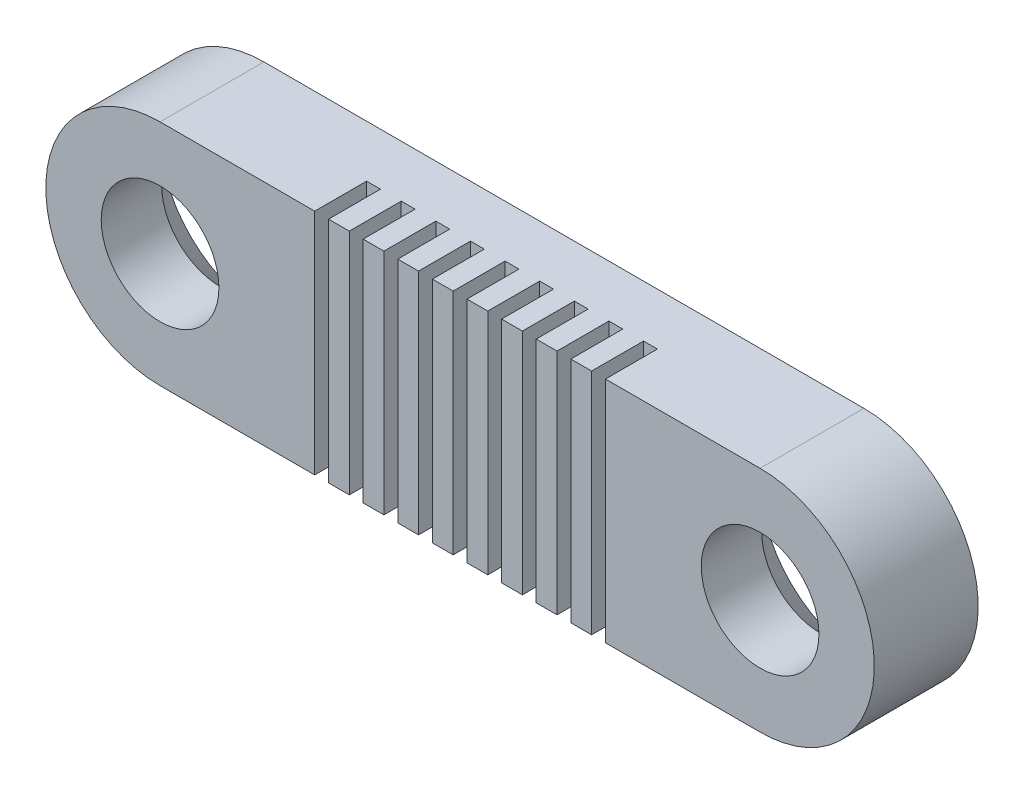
ISO-10303-21;
HEADER;
FILE_DESCRIPTION(('STEP AP214'),'2;1');
FILE_NAME('part.step','',(''),(''),'','','');
FILE_SCHEMA(('AUTOMOTIVE_DESIGN { 1 0 10303 214 1 1 1 1 }'));
ENDSEC;
DATA;
#1=APPLICATION_CONTEXT('core data for automotive mechanical design processes');
#2=APPLICATION_PROTOCOL_DEFINITION('international standard','automotive_design',2000,#1);
#3=PRODUCT_CONTEXT('',#1,'mechanical');
#4=PRODUCT('Part','Part','',(#3));
#5=PRODUCT_RELATED_PRODUCT_CATEGORY('part','',(#4));
#6=PRODUCT_DEFINITION_FORMATION('','',#4);
#7=PRODUCT_DEFINITION_CONTEXT('part definition',#1,'design');
#8=PRODUCT_DEFINITION('design','',#6,#7);
#9=PRODUCT_DEFINITION_SHAPE('','',#8);
#10=(LENGTH_UNIT() NAMED_UNIT(*) SI_UNIT(.MILLI.,.METRE.));
#11=(NAMED_UNIT(*) PLANE_ANGLE_UNIT() SI_UNIT($,.RADIAN.));
#12=(NAMED_UNIT(*) SI_UNIT($,.STERADIAN.) SOLID_ANGLE_UNIT());
#13=UNCERTAINTY_MEASURE_WITH_UNIT(LENGTH_MEASURE(1.E-05),#10,'distance_accuracy_value','');
#14=(GEOMETRIC_REPRESENTATION_CONTEXT(3) GLOBAL_UNCERTAINTY_ASSIGNED_CONTEXT((#13)) GLOBAL_UNIT_ASSIGNED_CONTEXT((#10,
#11,#12)) REPRESENTATION_CONTEXT('',''));
#15=CARTESIAN_POINT('',(0.,0.,0.));
#16=DIRECTION('',(0.,0.,1.));
#17=DIRECTION('',(1.,0.,0.));
#18=AXIS2_PLACEMENT_3D('',#15,#16,#17);
#19=CARTESIAN_POINT('',(17.3330952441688,-3.3,3.));
#20=DIRECTION('',(0.,0.,1.));
#21=DIRECTION('',(1.,0.,0.));
#22=AXIS2_PLACEMENT_3D('',#19,#20,#21);
#23=PLANE('',#22);
#24=DIRECTION('',(1.,0.,0.));
#25=VECTOR('',#24,1.);
#26=CARTESIAN_POINT('',(0.,-6.6,3.));
#27=LINE('',#26,#25);
#28=CARTESIAN_POINT('',(5.8665476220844,-6.6,3.));
#29=VERTEX_POINT('',#28);
#30=CARTESIAN_POINT('',(6.46654762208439,-6.6,3.));
#31=VERTEX_POINT('',#30);
#32=EDGE_CURVE('E347',#29,#31,#27,.T.);
#33=ORIENTED_EDGE('',*,*,#32,.T.);
#34=DIRECTION('',(0.,-1.,0.));
#35=VECTOR('',#34,1.);
#36=CARTESIAN_POINT('',(6.46654762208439,10.,3.));
#37=LINE('',#36,#35);
#38=CARTESIAN_POINT('',(6.46654762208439,0.,3.));
#39=VERTEX_POINT('',#38);
#40=EDGE_CURVE('E426',#39,#31,#37,.T.);
#41=ORIENTED_EDGE('',*,*,#40,.F.);
#42=DIRECTION('',(-1.,0.,0.));
#43=VECTOR('',#42,1.);
#44=CARTESIAN_POINT('',(17.3330952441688,0.,3.));
#45=LINE('',#44,#43);
#46=CARTESIAN_POINT('',(5.8665476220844,0.,3.));
#47=VERTEX_POINT('',#46);
#48=EDGE_CURVE('E590',#39,#47,#45,.T.);
#49=ORIENTED_EDGE('',*,*,#48,.T.);
#50=DIRECTION('',(0.,-1.,0.));
#51=VECTOR('',#50,1.);
#52=CARTESIAN_POINT('',(5.8665476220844,10.,3.));
#53=LINE('',#52,#51);
#54=EDGE_CURVE('E634',#47,#29,#53,.T.);
#55=ORIENTED_EDGE('',*,*,#54,.T.);
#56=EDGE_LOOP('',(#33,#41,#49,#55));
#57=FACE_BOUND('',#56,.T.);
#58=ADVANCED_FACE('F44',(#57),#23,.T.);
#59=CARTESIAN_POINT('',(7.46654762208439,0.,3.));
#60=VERTEX_POINT('',#59);
#61=CARTESIAN_POINT('',(6.8665476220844,0.,3.));
#62=VERTEX_POINT('',#61);
#63=EDGE_CURVE('E585',#60,#62,#45,.T.);
#64=ORIENTED_EDGE('',*,*,#63,.T.);
#65=DIRECTION('',(0.,-1.,0.));
#66=VECTOR('',#65,1.);
#67=CARTESIAN_POINT('',(6.8665476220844,10.,3.));
#68=LINE('',#67,#66);
#69=CARTESIAN_POINT('',(6.8665476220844,-6.6,3.));
#70=VERTEX_POINT('',#69);
#71=EDGE_CURVE('E608',#62,#70,#68,.T.);
#72=ORIENTED_EDGE('',*,*,#71,.T.);
#73=CARTESIAN_POINT('',(7.46654762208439,-6.6,3.));
#74=VERTEX_POINT('',#73);
#75=EDGE_CURVE('E362',#70,#74,#27,.T.);
#76=ORIENTED_EDGE('',*,*,#75,.T.);
#77=DIRECTION('',(0.,-1.,0.));
#78=VECTOR('',#77,1.);
#79=CARTESIAN_POINT('',(7.46654762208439,10.,3.));
#80=LINE('',#79,#78);
#81=EDGE_CURVE('E445',#60,#74,#80,.T.);
#82=ORIENTED_EDGE('',*,*,#81,.F.);
#83=EDGE_LOOP('',(#64,#72,#76,#82));
#84=FACE_BOUND('',#83,.T.);
#85=ADVANCED_FACE('F865',(#84),#23,.T.);
#86=CARTESIAN_POINT('',(4.8665476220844,-6.6,3.));
#87=VERTEX_POINT('',#86);
#88=CARTESIAN_POINT('',(5.46654762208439,-6.6,3.));
#89=VERTEX_POINT('',#88);
#90=EDGE_CURVE('E337',#87,#89,#27,.T.);
#91=ORIENTED_EDGE('',*,*,#90,.T.);
#92=DIRECTION('',(0.,-1.,0.));
#93=VECTOR('',#92,1.);
#94=CARTESIAN_POINT('',(5.46654762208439,10.,3.));
#95=LINE('',#94,#93);
#96=CARTESIAN_POINT('',(5.46654762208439,0.,3.));
#97=VERTEX_POINT('',#96);
#98=EDGE_CURVE('E631',#97,#89,#95,.T.);
#99=ORIENTED_EDGE('',*,*,#98,.F.);
#100=CARTESIAN_POINT('',(4.8665476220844,0.,3.));
#101=VERTEX_POINT('',#100);
#102=EDGE_CURVE('E593',#97,#101,#45,.T.);
#103=ORIENTED_EDGE('',*,*,#102,.T.);
#104=DIRECTION('',(0.,-1.,0.));
#105=VECTOR('',#104,1.);
#106=CARTESIAN_POINT('',(4.8665476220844,10.,3.));
#107=LINE('',#106,#105);
#108=EDGE_CURVE('E316',#101,#87,#107,.T.);
#109=ORIENTED_EDGE('',*,*,#108,.T.);
#110=EDGE_LOOP('',(#91,#99,#103,#109));
#111=FACE_BOUND('',#110,.T.);
#112=ADVANCED_FACE('F897',(#111),#23,.T.);
#113=CARTESIAN_POINT('',(0.,-3.3,3.));
#114=DIRECTION('',(0.,0.,1.));
#115=DIRECTION('',(1.,0.,0.));
#116=AXIS2_PLACEMENT_3D('',#113,#114,#115);
#117=CIRCLE('',#116,1.69999999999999);
#118=CARTESIAN_POINT('',(1.69999999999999,-3.3,3.));
#119=VERTEX_POINT('',#118);
#120=EDGE_CURVE('E554',#119,#119,#117,.T.);
#121=ORIENTED_EDGE('',*,*,#120,.F.);
#122=EDGE_LOOP('',(#121));
#123=FACE_BOUND('',#122,.T.);
#124=CARTESIAN_POINT('',(0.,-6.6,3.));
#125=VERTEX_POINT('',#124);
#126=CARTESIAN_POINT('',(4.46654762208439,-6.6,3.));
#127=VERTEX_POINT('',#126);
#128=EDGE_CURVE('E323',#125,#127,#27,.T.);
#129=ORIENTED_EDGE('',*,*,#128,.T.);
#130=DIRECTION('',(0.,-1.,0.));
#131=VECTOR('',#130,1.);
#132=CARTESIAN_POINT('',(4.46654762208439,10.,3.));
#133=LINE('',#132,#131);
#134=CARTESIAN_POINT('',(4.46654762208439,0.,3.));
#135=VERTEX_POINT('',#134);
#136=EDGE_CURVE('E303',#135,#127,#133,.T.);
#137=ORIENTED_EDGE('',*,*,#136,.F.);
#138=CARTESIAN_POINT('',(0.,0.,3.));
#139=VERTEX_POINT('',#138);
#140=EDGE_CURVE('E567',#135,#139,#45,.T.);
#141=ORIENTED_EDGE('',*,*,#140,.T.);
#142=CARTESIAN_POINT('',(0.,-3.3,3.));
#143=DIRECTION('',(0.,0.,1.));
#144=DIRECTION('',(1.,0.,0.));
#145=AXIS2_PLACEMENT_3D('',#142,#143,#144);
#146=CIRCLE('',#145,3.3);
#147=EDGE_CURVE('E333',#139,#125,#146,.T.);
#148=ORIENTED_EDGE('',*,*,#147,.T.);
#149=EDGE_LOOP('',(#129,#137,#141,#148));
#150=FACE_BOUND('',#149,.T.);
#151=ADVANCED_FACE('F331',(#123,#150),#23,.T.);
#152=CARTESIAN_POINT('',(8.46654762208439,0.,3.));
#153=VERTEX_POINT('',#152);
#154=CARTESIAN_POINT('',(7.8665476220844,0.,3.));
#155=VERTEX_POINT('',#154);
#156=EDGE_CURVE('E573',#153,#155,#45,.T.);
#157=ORIENTED_EDGE('',*,*,#156,.T.);
#158=DIRECTION('',(0.,-1.,0.));
#159=VECTOR('',#158,1.);
#160=CARTESIAN_POINT('',(7.8665476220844,10.,3.));
#161=LINE('',#160,#159);
#162=CARTESIAN_POINT('',(7.8665476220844,-6.6,3.));
#163=VERTEX_POINT('',#162);
#164=EDGE_CURVE('E441',#155,#163,#161,.T.);
#165=ORIENTED_EDGE('',*,*,#164,.T.);
#166=CARTESIAN_POINT('',(8.46654762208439,-6.6,3.));
#167=VERTEX_POINT('',#166);
#168=EDGE_CURVE('E354',#163,#167,#27,.T.);
#169=ORIENTED_EDGE('',*,*,#168,.T.);
#170=DIRECTION('',(0.,-1.,0.));
#171=VECTOR('',#170,1.);
#172=CARTESIAN_POINT('',(8.46654762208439,10.,3.));
#173=LINE('',#172,#171);
#174=EDGE_CURVE('E541',#153,#167,#173,.T.);
#175=ORIENTED_EDGE('',*,*,#174,.F.);
#176=EDGE_LOOP('',(#157,#165,#169,#175));
#177=FACE_BOUND('',#176,.T.);
#178=ADVANCED_FACE('F849',(#177),#23,.T.);
#179=CARTESIAN_POINT('',(11.8665476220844,-6.6,3.));
#180=VERTEX_POINT('',#179);
#181=CARTESIAN_POINT('',(12.4665476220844,-6.6,3.));
#182=VERTEX_POINT('',#181);
#183=EDGE_CURVE('E351',#180,#182,#27,.T.);
#184=ORIENTED_EDGE('',*,*,#183,.T.);
#185=DIRECTION('',(0.,-1.,0.));
#186=VECTOR('',#185,1.);
#187=CARTESIAN_POINT('',(12.4665476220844,10.,3.));
#188=LINE('',#187,#186);
#189=CARTESIAN_POINT('',(12.4665476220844,0.,3.));
#190=VERTEX_POINT('',#189);
#191=EDGE_CURVE('E383',#190,#182,#188,.T.);
#192=ORIENTED_EDGE('',*,*,#191,.F.);
#193=CARTESIAN_POINT('',(11.8665476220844,0.,3.));
#194=VERTEX_POINT('',#193);
#195=EDGE_CURVE('E572',#190,#194,#45,.T.);
#196=ORIENTED_EDGE('',*,*,#195,.T.);
#197=DIRECTION('',(0.,-1.,0.));
#198=VECTOR('',#197,1.);
#199=CARTESIAN_POINT('',(11.8665476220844,10.,3.));
#200=LINE('',#199,#198);
#201=EDGE_CURVE('E385',#194,#180,#200,.T.);
#202=ORIENTED_EDGE('',*,*,#201,.T.);
#203=EDGE_LOOP('',(#184,#192,#196,#202));
#204=FACE_BOUND('',#203,.T.);
#205=ADVANCED_FACE('F381',(#204),#23,.T.);
#206=CARTESIAN_POINT('',(17.3330952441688,-3.3,3.));
#207=DIRECTION('',(0.,0.,1.));
#208=DIRECTION('',(1.,0.,0.));
#209=AXIS2_PLACEMENT_3D('',#206,#207,#208);
#210=CIRCLE('',#209,1.69999999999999);
#211=CARTESIAN_POINT('',(19.0330952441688,-3.3,3.));
#212=VERTEX_POINT('',#211);
#213=EDGE_CURVE('E558',#212,#212,#210,.T.);
#214=ORIENTED_EDGE('',*,*,#213,.F.);
#215=EDGE_LOOP('',(#214));
#216=FACE_BOUND('',#215,.T.);
#217=CARTESIAN_POINT('',(17.3330952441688,0.,3.));
#218=VERTEX_POINT('',#217);
#219=CARTESIAN_POINT('',(12.8665476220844,0.,3.));
#220=VERTEX_POINT('',#219);
#221=EDGE_CURVE('E569',#218,#220,#45,.T.);
#222=ORIENTED_EDGE('',*,*,#221,.T.);
#223=DIRECTION('',(0.,-1.,0.));
#224=VECTOR('',#223,1.);
#225=CARTESIAN_POINT('',(12.8665476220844,10.,3.));
#226=LINE('',#225,#224);
#227=CARTESIAN_POINT('',(12.8665476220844,-6.6,3.));
#228=VERTEX_POINT('',#227);
#229=EDGE_CURVE('E415',#220,#228,#226,.T.);
#230=ORIENTED_EDGE('',*,*,#229,.T.);
#231=CARTESIAN_POINT('',(17.3330952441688,-6.6,3.));
#232=VERTEX_POINT('',#231);
#233=EDGE_CURVE('E339',#228,#232,#27,.T.);
#234=ORIENTED_EDGE('',*,*,#233,.T.);
#235=CARTESIAN_POINT('',(17.3330952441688,-3.3,3.));
#236=DIRECTION('',(0.,0.,1.));
#237=DIRECTION('',(1.,0.,0.));
#238=AXIS2_PLACEMENT_3D('',#235,#236,#237);
#239=CIRCLE('',#238,3.3);
#240=EDGE_CURVE('E563',#232,#218,#239,.T.);
#241=ORIENTED_EDGE('',*,*,#240,.T.);
#242=EDGE_LOOP('',(#222,#230,#234,#241));
#243=FACE_BOUND('',#242,.T.);
#244=ADVANCED_FACE('F783',(#216,#243),#23,.T.);
#245=CARTESIAN_POINT('',(10.8665476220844,-6.6,3.));
#246=VERTEX_POINT('',#245);
#247=CARTESIAN_POINT('',(11.4665476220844,-6.6,3.));
#248=VERTEX_POINT('',#247);
#249=EDGE_CURVE('E364',#246,#248,#27,.T.);
#250=ORIENTED_EDGE('',*,*,#249,.T.);
#251=DIRECTION('',(0.,-1.,0.));
#252=VECTOR('',#251,1.);
#253=CARTESIAN_POINT('',(11.4665476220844,10.,3.));
#254=LINE('',#253,#252);
#255=CARTESIAN_POINT('',(11.4665476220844,0.,3.));
#256=VERTEX_POINT('',#255);
#257=EDGE_CURVE('E404',#256,#248,#254,.T.);
#258=ORIENTED_EDGE('',*,*,#257,.F.);
#259=CARTESIAN_POINT('',(10.8665476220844,0.,3.));
#260=VERTEX_POINT('',#259);
#261=EDGE_CURVE('E577',#256,#260,#45,.T.);
#262=ORIENTED_EDGE('',*,*,#261,.T.);
#263=DIRECTION('',(0.,-1.,0.));
#264=VECTOR('',#263,1.);
#265=CARTESIAN_POINT('',(10.8665476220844,10.,3.));
#266=LINE('',#265,#264);
#267=EDGE_CURVE('E696',#260,#246,#266,.T.);
#268=ORIENTED_EDGE('',*,*,#267,.T.);
#269=EDGE_LOOP('',(#250,#258,#262,#268));
#270=FACE_BOUND('',#269,.T.);
#271=ADVANCED_FACE('F803',(#270),#23,.T.);
#272=CARTESIAN_POINT('',(9.86654762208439,-6.6,3.));
#273=VERTEX_POINT('',#272);
#274=CARTESIAN_POINT('',(10.4665476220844,-6.6,3.));
#275=VERTEX_POINT('',#274);
#276=EDGE_CURVE('E355',#273,#275,#27,.T.);
#277=ORIENTED_EDGE('',*,*,#276,.T.);
#278=DIRECTION('',(0.,-1.,0.));
#279=VECTOR('',#278,1.);
#280=CARTESIAN_POINT('',(10.4665476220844,10.,3.));
#281=LINE('',#280,#279);
#282=CARTESIAN_POINT('',(10.4665476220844,0.,3.));
#283=VERTEX_POINT('',#282);
#284=EDGE_CURVE('E693',#283,#275,#281,.T.);
#285=ORIENTED_EDGE('',*,*,#284,.F.);
#286=CARTESIAN_POINT('',(9.86654762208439,0.,3.));
#287=VERTEX_POINT('',#286);
#288=EDGE_CURVE('E580',#283,#287,#45,.T.);
#289=ORIENTED_EDGE('',*,*,#288,.T.);
#290=DIRECTION('',(0.,-1.,0.));
#291=VECTOR('',#290,1.);
#292=CARTESIAN_POINT('',(9.86654762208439,10.,3.));
#293=LINE('',#292,#291);
#294=EDGE_CURVE('E671',#287,#273,#293,.T.);
#295=ORIENTED_EDGE('',*,*,#294,.T.);
#296=EDGE_LOOP('',(#277,#285,#289,#295));
#297=FACE_BOUND('',#296,.T.);
#298=ADVANCED_FACE('F817',(#297),#23,.T.);
#299=CARTESIAN_POINT('',(8.8665476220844,-6.6,3.));
#300=VERTEX_POINT('',#299);
#301=CARTESIAN_POINT('',(9.46654762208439,-6.6,3.));
#302=VERTEX_POINT('',#301);
#303=EDGE_CURVE('E340',#300,#302,#27,.T.);
#304=ORIENTED_EDGE('',*,*,#303,.T.);
#305=DIRECTION('',(0.,-1.,0.));
#306=VECTOR('',#305,1.);
#307=CARTESIAN_POINT('',(9.46654762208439,10.,3.));
#308=LINE('',#307,#306);
#309=CARTESIAN_POINT('',(9.46654762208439,0.,3.));
#310=VERTEX_POINT('',#309);
#311=EDGE_CURVE('E329',#310,#302,#308,.T.);
#312=ORIENTED_EDGE('',*,*,#311,.F.);
#313=CARTESIAN_POINT('',(8.8665476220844,0.,3.));
#314=VERTEX_POINT('',#313);
#315=EDGE_CURVE('E583',#310,#314,#45,.T.);
#316=ORIENTED_EDGE('',*,*,#315,.T.);
#317=DIRECTION('',(0.,-1.,0.));
#318=VECTOR('',#317,1.);
#319=CARTESIAN_POINT('',(8.8665476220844,10.,3.));
#320=LINE('',#319,#318);
#321=EDGE_CURVE('E538',#314,#300,#320,.T.);
#322=ORIENTED_EDGE('',*,*,#321,.T.);
#323=EDGE_LOOP('',(#304,#312,#316,#322));
#324=FACE_BOUND('',#323,.T.);
#325=ADVANCED_FACE('F832',(#324),#23,.T.);
#326=CARTESIAN_POINT('',(17.3330952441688,0.,3.));
#327=DIRECTION('',(0.,-1.,0.));
#328=DIRECTION('',(1.,0.,0.));
#329=AXIS2_PLACEMENT_3D('',#326,#327,#328);
#330=PLANE('',#329);
#331=DIRECTION('',(0.,0.,1.));
#332=VECTOR('',#331,1.);
#333=CARTESIAN_POINT('',(12.4665476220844,0.,3.));
#334=LINE('',#333,#332);
#335=CARTESIAN_POINT('',(12.4665476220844,0.,1.5));
#336=VERTEX_POINT('',#335);
#337=EDGE_CURVE('E516',#336,#190,#334,.T.);
#338=ORIENTED_EDGE('',*,*,#337,.F.);
#339=DIRECTION('',(-1.,0.,0.));
#340=VECTOR('',#339,1.);
#341=CARTESIAN_POINT('',(17.3330952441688,0.,1.5));
#342=LINE('',#341,#340);
#343=CARTESIAN_POINT('',(12.8665476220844,0.,1.5));
#344=VERTEX_POINT('',#343);
#345=EDGE_CURVE('E510',#344,#336,#342,.T.);
#346=ORIENTED_EDGE('',*,*,#345,.F.);
#347=DIRECTION('',(0.,0.,-1.));
#348=VECTOR('',#347,1.);
#349=CARTESIAN_POINT('',(12.8665476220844,0.,3.));
#350=LINE('',#349,#348);
#351=EDGE_CURVE('E513',#220,#344,#350,.T.);
#352=ORIENTED_EDGE('',*,*,#351,.F.);
#353=ORIENTED_EDGE('',*,*,#221,.F.);
#354=DIRECTION('',(0.,0.,-1.));
#355=VECTOR('',#354,1.);
#356=CARTESIAN_POINT('',(17.3330952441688,0.,3.));
#357=LINE('',#356,#355);
#358=CARTESIAN_POINT('',(17.3330952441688,0.,0.));
#359=VERTEX_POINT('',#358);
#360=EDGE_CURVE('E11',#218,#359,#357,.T.);
#361=ORIENTED_EDGE('',*,*,#360,.T.);
#362=DIRECTION('',(-1.,0.,0.));
#363=VECTOR('',#362,1.);
#364=CARTESIAN_POINT('',(17.3330952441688,0.,0.));
#365=LINE('',#364,#363);
#366=CARTESIAN_POINT('',(0.,0.,0.));
#367=VERTEX_POINT('',#366);
#368=EDGE_CURVE('E601',#359,#367,#365,.T.);
#369=ORIENTED_EDGE('',*,*,#368,.T.);
#370=DIRECTION('',(0.,0.,-1.));
#371=VECTOR('',#370,1.);
#372=CARTESIAN_POINT('',(0.,0.,3.));
#373=LINE('',#372,#371);
#374=EDGE_CURVE('E53',#139,#367,#373,.T.);
#375=ORIENTED_EDGE('',*,*,#374,.F.);
#376=ORIENTED_EDGE('',*,*,#140,.F.);
#377=DIRECTION('',(0.,0.,1.));
#378=VECTOR('',#377,1.);
#379=CARTESIAN_POINT('',(4.46654762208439,0.,3.));
#380=LINE('',#379,#378);
#381=CARTESIAN_POINT('',(4.46654762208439,0.,1.5));
#382=VERTEX_POINT('',#381);
#383=EDGE_CURVE('E310',#382,#135,#380,.T.);
#384=ORIENTED_EDGE('',*,*,#383,.F.);
#385=DIRECTION('',(-1.,0.,0.));
#386=VECTOR('',#385,1.);
#387=CARTESIAN_POINT('',(17.3330952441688,0.,1.5));
#388=LINE('',#387,#386);
#389=CARTESIAN_POINT('',(4.8665476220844,0.,1.5));
#390=VERTEX_POINT('',#389);
#391=EDGE_CURVE('E466',#390,#382,#388,.T.);
#392=ORIENTED_EDGE('',*,*,#391,.F.);
#393=DIRECTION('',(0.,0.,-1.));
#394=VECTOR('',#393,1.);
#395=CARTESIAN_POINT('',(4.8665476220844,0.,3.));
#396=LINE('',#395,#394);
#397=EDGE_CURVE('E469',#101,#390,#396,.T.);
#398=ORIENTED_EDGE('',*,*,#397,.F.);
#399=ORIENTED_EDGE('',*,*,#102,.F.);
#400=DIRECTION('',(0.,0.,1.));
#401=VECTOR('',#400,1.);
#402=CARTESIAN_POINT('',(5.46654762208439,0.,3.));
#403=LINE('',#402,#401);
#404=CARTESIAN_POINT('',(5.46654762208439,0.,1.5));
#405=VERTEX_POINT('',#404);
#406=EDGE_CURVE('E480',#405,#97,#403,.T.);
#407=ORIENTED_EDGE('',*,*,#406,.F.);
#408=DIRECTION('',(-1.,0.,0.));
#409=VECTOR('',#408,1.);
#410=CARTESIAN_POINT('',(17.3330952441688,0.,1.5));
#411=LINE('',#410,#409);
#412=CARTESIAN_POINT('',(5.8665476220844,0.,1.5));
#413=VERTEX_POINT('',#412);
#414=EDGE_CURVE('E474',#413,#405,#411,.T.);
#415=ORIENTED_EDGE('',*,*,#414,.F.);
#416=DIRECTION('',(0.,0.,-1.));
#417=VECTOR('',#416,1.);
#418=CARTESIAN_POINT('',(5.86654762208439,0.,3.));
#419=LINE('',#418,#417);
#420=EDGE_CURVE('E477',#47,#413,#419,.T.);
#421=ORIENTED_EDGE('',*,*,#420,.F.);
#422=ORIENTED_EDGE('',*,*,#48,.F.);
#423=DIRECTION('',(0.,0.,1.));
#424=VECTOR('',#423,1.);
#425=CARTESIAN_POINT('',(6.46654762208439,0.,3.));
#426=LINE('',#425,#424);
#427=CARTESIAN_POINT('',(6.46654762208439,0.,1.5));
#428=VERTEX_POINT('',#427);
#429=EDGE_CURVE('E489',#428,#39,#426,.T.);
#430=ORIENTED_EDGE('',*,*,#429,.F.);
#431=DIRECTION('',(-1.,0.,0.));
#432=VECTOR('',#431,1.);
#433=CARTESIAN_POINT('',(17.3330952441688,0.,1.5));
#434=LINE('',#433,#432);
#435=CARTESIAN_POINT('',(6.8665476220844,0.,1.5));
#436=VERTEX_POINT('',#435);
#437=EDGE_CURVE('E483',#436,#428,#434,.T.);
#438=ORIENTED_EDGE('',*,*,#437,.F.);
#439=DIRECTION('',(0.,0.,-1.));
#440=VECTOR('',#439,1.);
#441=CARTESIAN_POINT('',(6.8665476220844,0.,3.));
#442=LINE('',#441,#440);
#443=EDGE_CURVE('E486',#62,#436,#442,.T.);
#444=ORIENTED_EDGE('',*,*,#443,.F.);
#445=ORIENTED_EDGE('',*,*,#63,.F.);
#446=DIRECTION('',(0.,0.,1.));
#447=VECTOR('',#446,1.);
#448=CARTESIAN_POINT('',(7.46654762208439,0.,3.));
#449=LINE('',#448,#447);
#450=CARTESIAN_POINT('',(7.46654762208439,0.,1.5));
#451=VERTEX_POINT('',#450);
#452=EDGE_CURVE('E454',#451,#60,#449,.T.);
#453=ORIENTED_EDGE('',*,*,#452,.F.);
#454=DIRECTION('',(-1.,0.,0.));
#455=VECTOR('',#454,1.);
#456=CARTESIAN_POINT('',(17.3330952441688,0.,1.5));
#457=LINE('',#456,#455);
#458=CARTESIAN_POINT('',(7.8665476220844,0.,1.5));
#459=VERTEX_POINT('',#458);
#460=EDGE_CURVE('E448',#459,#451,#457,.T.);
#461=ORIENTED_EDGE('',*,*,#460,.F.);
#462=DIRECTION('',(0.,0.,-1.));
#463=VECTOR('',#462,1.);
#464=CARTESIAN_POINT('',(7.8665476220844,0.,3.));
#465=LINE('',#464,#463);
#466=EDGE_CURVE('E451',#155,#459,#465,.T.);
#467=ORIENTED_EDGE('',*,*,#466,.F.);
#468=ORIENTED_EDGE('',*,*,#156,.F.);
#469=DIRECTION('',(0.,0.,1.));
#470=VECTOR('',#469,1.);
#471=CARTESIAN_POINT('',(8.46654762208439,0.,3.));
#472=LINE('',#471,#470);
#473=CARTESIAN_POINT('',(8.46654762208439,0.,1.5));
#474=VERTEX_POINT('',#473);
#475=EDGE_CURVE('E551',#474,#153,#472,.T.);
#476=ORIENTED_EDGE('',*,*,#475,.F.);
#477=DIRECTION('',(-1.,0.,0.));
#478=VECTOR('',#477,1.);
#479=CARTESIAN_POINT('',(17.3330952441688,0.,1.5));
#480=LINE('',#479,#478);
#481=CARTESIAN_POINT('',(8.8665476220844,0.,1.5));
#482=VERTEX_POINT('',#481);
#483=EDGE_CURVE('E545',#482,#474,#480,.T.);
#484=ORIENTED_EDGE('',*,*,#483,.F.);
#485=DIRECTION('',(0.,0.,-1.));
#486=VECTOR('',#485,1.);
#487=CARTESIAN_POINT('',(8.8665476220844,0.,3.));
#488=LINE('',#487,#486);
#489=EDGE_CURVE('E548',#314,#482,#488,.T.);
#490=ORIENTED_EDGE('',*,*,#489,.F.);
#491=ORIENTED_EDGE('',*,*,#315,.F.);
#492=DIRECTION('',(0.,0.,1.));
#493=VECTOR('',#492,1.);
#494=CARTESIAN_POINT('',(9.46654762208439,0.,3.));
#495=LINE('',#494,#493);
#496=CARTESIAN_POINT('',(9.46654762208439,0.,1.5));
#497=VERTEX_POINT('',#496);
#498=EDGE_CURVE('E463',#497,#310,#495,.T.);
#499=ORIENTED_EDGE('',*,*,#498,.F.);
#500=DIRECTION('',(-1.,0.,0.));
#501=VECTOR('',#500,1.);
#502=CARTESIAN_POINT('',(17.3330952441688,0.,1.5));
#503=LINE('',#502,#501);
#504=CARTESIAN_POINT('',(9.86654762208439,0.,1.5));
#505=VERTEX_POINT('',#504);
#506=EDGE_CURVE('E457',#505,#497,#503,.T.);
#507=ORIENTED_EDGE('',*,*,#506,.F.);
#508=DIRECTION('',(0.,0.,-1.));
#509=VECTOR('',#508,1.);
#510=CARTESIAN_POINT('',(9.86654762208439,0.,3.));
#511=LINE('',#510,#509);
#512=EDGE_CURVE('E460',#287,#505,#511,.T.);
#513=ORIENTED_EDGE('',*,*,#512,.F.);
#514=ORIENTED_EDGE('',*,*,#288,.F.);
#515=DIRECTION('',(0.,0.,1.));
#516=VECTOR('',#515,1.);
#517=CARTESIAN_POINT('',(10.4665476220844,0.,3.));
#518=LINE('',#517,#516);
#519=CARTESIAN_POINT('',(10.4665476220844,0.,1.5));
#520=VERTEX_POINT('',#519);
#521=EDGE_CURVE('E498',#520,#283,#518,.T.);
#522=ORIENTED_EDGE('',*,*,#521,.F.);
#523=DIRECTION('',(-1.,0.,0.));
#524=VECTOR('',#523,1.);
#525=CARTESIAN_POINT('',(17.3330952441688,0.,1.5));
#526=LINE('',#525,#524);
#527=CARTESIAN_POINT('',(10.8665476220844,0.,1.5));
#528=VERTEX_POINT('',#527);
#529=EDGE_CURVE('E492',#528,#520,#526,.T.);
#530=ORIENTED_EDGE('',*,*,#529,.F.);
#531=DIRECTION('',(0.,0.,-1.));
#532=VECTOR('',#531,1.);
#533=CARTESIAN_POINT('',(10.8665476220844,0.,3.));
#534=LINE('',#533,#532);
#535=EDGE_CURVE('E495',#260,#528,#534,.T.);
#536=ORIENTED_EDGE('',*,*,#535,.F.);
#537=ORIENTED_EDGE('',*,*,#261,.F.);
#538=DIRECTION('',(0.,0.,1.));
#539=VECTOR('',#538,1.);
#540=CARTESIAN_POINT('',(11.4665476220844,0.,3.));
#541=LINE('',#540,#539);
#542=CARTESIAN_POINT('',(11.4665476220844,0.,1.5));
#543=VERTEX_POINT('',#542);
#544=EDGE_CURVE('E507',#543,#256,#541,.T.);
#545=ORIENTED_EDGE('',*,*,#544,.F.);
#546=DIRECTION('',(-1.,0.,0.));
#547=VECTOR('',#546,1.);
#548=CARTESIAN_POINT('',(17.3330952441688,0.,1.5));
#549=LINE('',#548,#547);
#550=CARTESIAN_POINT('',(11.8665476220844,0.,1.5));
#551=VERTEX_POINT('',#550);
#552=EDGE_CURVE('E501',#551,#543,#549,.T.);
#553=ORIENTED_EDGE('',*,*,#552,.F.);
#554=DIRECTION('',(0.,0.,-1.));
#555=VECTOR('',#554,1.);
#556=CARTESIAN_POINT('',(11.8665476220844,0.,3.));
#557=LINE('',#556,#555);
#558=EDGE_CURVE('E504',#194,#551,#557,.T.);
#559=ORIENTED_EDGE('',*,*,#558,.F.);
#560=ORIENTED_EDGE('',*,*,#195,.F.);
#561=EDGE_LOOP('',(#338,#346,#352,#353,#361,#369,#375,#376,#384,#392,#398,#399,#407,#415,#421,
#422,#430,#438,#444,#445,#453,#461,#467,#468,#476,#484,#490,#491,#499,#507,#513,#514,#522,#530,
#536,#537,#545,#553,#559,#560));
#562=FACE_BOUND('',#561,.T.);
#563=ADVANCED_FACE('F779',(#562),#330,.F.);
#564=CARTESIAN_POINT('',(0.,-6.6,3.));
#565=DIRECTION('',(0.,1.,0.));
#566=DIRECTION('',(-1.,0.,0.));
#567=AXIS2_PLACEMENT_3D('',#564,#565,#566);
#568=PLANE('',#567);
#569=DIRECTION('',(0.,0.,1.));
#570=VECTOR('',#569,1.);
#571=CARTESIAN_POINT('',(12.4665476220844,-6.6,3.));
#572=LINE('',#571,#570);
#573=CARTESIAN_POINT('',(12.4665476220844,-6.6,1.5));
#574=VERTEX_POINT('',#573);
#575=EDGE_CURVE('E60',#574,#182,#572,.T.);
#576=ORIENTED_EDGE('',*,*,#575,.T.);
#577=ORIENTED_EDGE('',*,*,#183,.F.);
#578=DIRECTION('',(0.,0.,-1.));
#579=VECTOR('',#578,1.);
#580=CARTESIAN_POINT('',(11.8665476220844,-6.6,3.));
#581=LINE('',#580,#579);
#582=CARTESIAN_POINT('',(11.8665476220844,-6.6,1.5));
#583=VERTEX_POINT('',#582);
#584=EDGE_CURVE('E388',#180,#583,#581,.T.);
#585=ORIENTED_EDGE('',*,*,#584,.T.);
#586=DIRECTION('',(-1.,0.,0.));
#587=VECTOR('',#586,1.);
#588=CARTESIAN_POINT('',(11.4665476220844,-6.6,1.5));
#589=LINE('',#588,#587);
#590=CARTESIAN_POINT('',(11.4665476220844,-6.6,1.5));
#591=VERTEX_POINT('',#590);
#592=EDGE_CURVE('E726',#583,#591,#589,.T.);
#593=ORIENTED_EDGE('',*,*,#592,.T.);
#594=DIRECTION('',(0.,0.,1.));
#595=VECTOR('',#594,1.);
#596=CARTESIAN_POINT('',(11.4665476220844,-6.6,3.));
#597=LINE('',#596,#595);
#598=EDGE_CURVE('E68',#591,#248,#597,.T.);
#599=ORIENTED_EDGE('',*,*,#598,.T.);
#600=ORIENTED_EDGE('',*,*,#249,.F.);
#601=DIRECTION('',(0.,0.,-1.));
#602=VECTOR('',#601,1.);
#603=CARTESIAN_POINT('',(10.8665476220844,-6.6,3.));
#604=LINE('',#603,#602);
#605=CARTESIAN_POINT('',(10.8665476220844,-6.6,1.5));
#606=VERTEX_POINT('',#605);
#607=EDGE_CURVE('E710',#246,#606,#604,.T.);
#608=ORIENTED_EDGE('',*,*,#607,.T.);
#609=DIRECTION('',(-1.,0.,0.));
#610=VECTOR('',#609,1.);
#611=CARTESIAN_POINT('',(10.4665476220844,-6.6,1.5));
#612=LINE('',#611,#610);
#613=CARTESIAN_POINT('',(10.4665476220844,-6.6,1.5));
#614=VERTEX_POINT('',#613);
#615=EDGE_CURVE('E706',#606,#614,#612,.T.);
#616=ORIENTED_EDGE('',*,*,#615,.T.);
#617=DIRECTION('',(0.,0.,1.));
#618=VECTOR('',#617,1.);
#619=CARTESIAN_POINT('',(10.4665476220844,-6.6,3.));
#620=LINE('',#619,#618);
#621=EDGE_CURVE('E714',#614,#275,#620,.T.);
#622=ORIENTED_EDGE('',*,*,#621,.T.);
#623=ORIENTED_EDGE('',*,*,#276,.F.);
#624=DIRECTION('',(0.,0.,-1.));
#625=VECTOR('',#624,1.);
#626=CARTESIAN_POINT('',(9.86654762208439,-6.6,3.));
#627=LINE('',#626,#625);
#628=CARTESIAN_POINT('',(9.86654762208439,-6.6,1.5));
#629=VERTEX_POINT('',#628);
#630=EDGE_CURVE('E685',#273,#629,#627,.T.);
#631=ORIENTED_EDGE('',*,*,#630,.T.);
#632=DIRECTION('',(-1.,0.,0.));
#633=VECTOR('',#632,1.);
#634=CARTESIAN_POINT('',(9.46654762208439,-6.6,1.5));
#635=LINE('',#634,#633);
#636=CARTESIAN_POINT('',(9.46654762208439,-6.6,1.5));
#637=VERTEX_POINT('',#636);
#638=EDGE_CURVE('E681',#629,#637,#635,.T.);
#639=ORIENTED_EDGE('',*,*,#638,.T.);
#640=DIRECTION('',(0.,0.,1.));
#641=VECTOR('',#640,1.);
#642=CARTESIAN_POINT('',(9.46654762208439,-6.6,3.));
#643=LINE('',#642,#641);
#644=EDGE_CURVE('E689',#637,#302,#643,.T.);
#645=ORIENTED_EDGE('',*,*,#644,.T.);
#646=ORIENTED_EDGE('',*,*,#303,.F.);
#647=DIRECTION('',(0.,0.,-1.));
#648=VECTOR('',#647,1.);
#649=CARTESIAN_POINT('',(8.8665476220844,-6.6,3.));
#650=LINE('',#649,#648);
#651=CARTESIAN_POINT('',(8.8665476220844,-6.6,1.5));
#652=VERTEX_POINT('',#651);
#653=EDGE_CURVE('E523',#300,#652,#650,.T.);
#654=ORIENTED_EDGE('',*,*,#653,.T.);
#655=DIRECTION('',(-1.,0.,0.));
#656=VECTOR('',#655,1.);
#657=CARTESIAN_POINT('',(8.46654762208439,-6.6,1.5));
#658=LINE('',#657,#656);
#659=CARTESIAN_POINT('',(8.46654762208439,-6.6,1.5));
#660=VERTEX_POINT('',#659);
#661=EDGE_CURVE('E527',#652,#660,#658,.T.);
#662=ORIENTED_EDGE('',*,*,#661,.T.);
#663=DIRECTION('',(0.,0.,1.));
#664=VECTOR('',#663,1.);
#665=CARTESIAN_POINT('',(8.46654762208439,-6.6,3.));
#666=LINE('',#665,#664);
#667=EDGE_CURVE('E519',#660,#167,#666,.T.);
#668=ORIENTED_EDGE('',*,*,#667,.T.);
#669=ORIENTED_EDGE('',*,*,#168,.F.);
#670=DIRECTION('',(0.,0.,-1.));
#671=VECTOR('',#670,1.);
#672=CARTESIAN_POINT('',(7.8665476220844,-6.6,3.));
#673=LINE('',#672,#671);
#674=CARTESIAN_POINT('',(7.8665476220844,-6.6,1.5));
#675=VERTEX_POINT('',#674);
#676=EDGE_CURVE('E425',#163,#675,#673,.T.);
#677=ORIENTED_EDGE('',*,*,#676,.T.);
#678=DIRECTION('',(-1.,0.,0.));
#679=VECTOR('',#678,1.);
#680=CARTESIAN_POINT('',(7.46654762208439,-6.6,1.5));
#681=LINE('',#680,#679);
#682=CARTESIAN_POINT('',(7.46654762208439,-6.6,1.5));
#683=VERTEX_POINT('',#682);
#684=EDGE_CURVE('E430',#675,#683,#681,.T.);
#685=ORIENTED_EDGE('',*,*,#684,.T.);
#686=DIRECTION('',(0.,0.,1.));
#687=VECTOR('',#686,1.);
#688=CARTESIAN_POINT('',(7.46654762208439,-6.6,3.));
#689=LINE('',#688,#687);
#690=EDGE_CURVE('E421',#683,#74,#689,.T.);
#691=ORIENTED_EDGE('',*,*,#690,.T.);
#692=ORIENTED_EDGE('',*,*,#75,.F.);
#693=DIRECTION('',(0.,0.,-1.));
#694=VECTOR('',#693,1.);
#695=CARTESIAN_POINT('',(6.8665476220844,-6.6,3.));
#696=LINE('',#695,#694);
#697=CARTESIAN_POINT('',(6.8665476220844,-6.6,1.5));
#698=VERTEX_POINT('',#697);
#699=EDGE_CURVE('E623',#70,#698,#696,.T.);
#700=ORIENTED_EDGE('',*,*,#699,.T.);
#701=DIRECTION('',(-1.,0.,0.));
#702=VECTOR('',#701,1.);
#703=CARTESIAN_POINT('',(6.46654762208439,-6.6,1.5));
#704=LINE('',#703,#702);
#705=CARTESIAN_POINT('',(6.46654762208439,-6.6,1.5));
#706=VERTEX_POINT('',#705);
#707=EDGE_CURVE('E619',#698,#706,#704,.T.);
#708=ORIENTED_EDGE('',*,*,#707,.T.);
#709=DIRECTION('',(0.,0.,1.));
#710=VECTOR('',#709,1.);
#711=CARTESIAN_POINT('',(6.46654762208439,-6.6,3.));
#712=LINE('',#711,#710);
#713=EDGE_CURVE('E627',#706,#31,#712,.T.);
#714=ORIENTED_EDGE('',*,*,#713,.T.);
#715=ORIENTED_EDGE('',*,*,#32,.F.);
#716=DIRECTION('',(0.,0.,-1.));
#717=VECTOR('',#716,1.);
#718=CARTESIAN_POINT('',(5.8665476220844,-6.6,3.));
#719=LINE('',#718,#717);
#720=CARTESIAN_POINT('',(5.8665476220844,-6.6,1.5));
#721=VERTEX_POINT('',#720);
#722=EDGE_CURVE('E649',#29,#721,#719,.T.);
#723=ORIENTED_EDGE('',*,*,#722,.T.);
#724=DIRECTION('',(-1.,0.,0.));
#725=VECTOR('',#724,1.);
#726=CARTESIAN_POINT('',(5.46654762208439,-6.6,1.5));
#727=LINE('',#726,#725);
#728=CARTESIAN_POINT('',(5.46654762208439,-6.6,1.5));
#729=VERTEX_POINT('',#728);
#730=EDGE_CURVE('E645',#721,#729,#727,.T.);
#731=ORIENTED_EDGE('',*,*,#730,.T.);
#732=DIRECTION('',(0.,0.,1.));
#733=VECTOR('',#732,1.);
#734=CARTESIAN_POINT('',(5.46654762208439,-6.6,3.));
#735=LINE('',#734,#733);
#736=EDGE_CURVE('E315',#729,#89,#735,.T.);
#737=ORIENTED_EDGE('',*,*,#736,.T.);
#738=ORIENTED_EDGE('',*,*,#90,.F.);
#739=DIRECTION('',(0.,0.,-1.));
#740=VECTOR('',#739,1.);
#741=CARTESIAN_POINT('',(4.8665476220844,-6.6,3.));
#742=LINE('',#741,#740);
#743=CARTESIAN_POINT('',(4.8665476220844,-6.6,1.5));
#744=VERTEX_POINT('',#743);
#745=EDGE_CURVE('E328',#87,#744,#742,.T.);
#746=ORIENTED_EDGE('',*,*,#745,.T.);
#747=DIRECTION('',(-1.,0.,0.));
#748=VECTOR('',#747,1.);
#749=CARTESIAN_POINT('',(4.46654762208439,-6.6,1.5));
#750=LINE('',#749,#748);
#751=CARTESIAN_POINT('',(4.46654762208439,-6.6,1.5));
#752=VERTEX_POINT('',#751);
#753=EDGE_CURVE('E326',#744,#752,#750,.T.);
#754=ORIENTED_EDGE('',*,*,#753,.T.);
#755=DIRECTION('',(0.,0.,1.));
#756=VECTOR('',#755,1.);
#757=CARTESIAN_POINT('',(4.46654762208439,-6.6,3.));
#758=LINE('',#757,#756);
#759=EDGE_CURVE('E307',#752,#127,#758,.T.);
#760=ORIENTED_EDGE('',*,*,#759,.T.);
#761=ORIENTED_EDGE('',*,*,#128,.F.);
#762=DIRECTION('',(0.,0.,-1.));
#763=VECTOR('',#762,1.);
#764=CARTESIAN_POINT('',(0.,-6.6,3.));
#765=LINE('',#764,#763);
#766=CARTESIAN_POINT('',(0.,-6.6,0.));
#767=VERTEX_POINT('',#766);
#768=EDGE_CURVE('E344',#125,#767,#765,.T.);
#769=ORIENTED_EDGE('',*,*,#768,.T.);
#770=DIRECTION('',(1.,0.,0.));
#771=VECTOR('',#770,1.);
#772=CARTESIAN_POINT('',(0.,-6.6,0.));
#773=LINE('',#772,#771);
#774=CARTESIAN_POINT('',(17.3330952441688,-6.6,0.));
#775=VERTEX_POINT('',#774);
#776=EDGE_CURVE('E568',#767,#775,#773,.T.);
#777=ORIENTED_EDGE('',*,*,#776,.T.);
#778=DIRECTION('',(0.,0.,-1.));
#779=VECTOR('',#778,1.);
#780=CARTESIAN_POINT('',(17.3330952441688,-6.6,3.));
#781=LINE('',#780,#779);
#782=EDGE_CURVE('E336',#232,#775,#781,.T.);
#783=ORIENTED_EDGE('',*,*,#782,.F.);
#784=ORIENTED_EDGE('',*,*,#233,.F.);
#785=DIRECTION('',(0.,0.,-1.));
#786=VECTOR('',#785,1.);
#787=CARTESIAN_POINT('',(12.8665476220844,-6.6,3.));
#788=LINE('',#787,#786);
#789=CARTESIAN_POINT('',(12.8665476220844,-6.6,1.5));
#790=VERTEX_POINT('',#789);
#791=EDGE_CURVE('E394',#228,#790,#788,.T.);
#792=ORIENTED_EDGE('',*,*,#791,.T.);
#793=DIRECTION('',(-1.,0.,0.));
#794=VECTOR('',#793,1.);
#795=CARTESIAN_POINT('',(12.4665476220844,-6.6,1.5));
#796=LINE('',#795,#794);
#797=EDGE_CURVE('E392',#790,#574,#796,.T.);
#798=ORIENTED_EDGE('',*,*,#797,.T.);
#799=EDGE_LOOP('',(#576,#577,#585,#593,#599,#600,#608,#616,#622,#623,#631,#639,#645,#646,#654,
#662,#668,#669,#677,#685,#691,#692,#700,#708,#714,#715,#723,#731,#737,#738,#746,#754,#760,#761,
#769,#777,#783,#784,#792,#798));
#800=FACE_BOUND('',#799,.T.);
#801=ADVANCED_FACE('F321',(#800),#568,.F.);
#802=CARTESIAN_POINT('',(17.3330952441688,-3.3,0.));
#803=DIRECTION('',(0.,0.,1.));
#804=DIRECTION('',(1.,0.,0.));
#805=AXIS2_PLACEMENT_3D('',#802,#803,#804);
#806=PLANE('',#805);
#807=CARTESIAN_POINT('',(17.3330952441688,-3.3,0.));
#808=DIRECTION('',(0.,0.,-1.));
#809=DIRECTION('',(-1.,0.,0.));
#810=AXIS2_PLACEMENT_3D('',#807,#808,#809);
#811=CIRCLE('',#810,3.);
#812=CARTESIAN_POINT('',(14.3330952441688,-3.3,0.));
#813=VERTEX_POINT('',#812);
#814=EDGE_CURVE('E737',#813,#813,#811,.T.);
#815=ORIENTED_EDGE('',*,*,#814,.F.);
#816=EDGE_LOOP('',(#815));
#817=FACE_BOUND('',#816,.T.);
#818=CARTESIAN_POINT('',(0.,-3.3,0.));
#819=DIRECTION('',(0.,0.,-1.));
#820=DIRECTION('',(-1.,0.,0.));
#821=AXIS2_PLACEMENT_3D('',#818,#819,#820);
#822=CIRCLE('',#821,3.);
#823=CARTESIAN_POINT('',(-3.,-3.3,0.));
#824=VERTEX_POINT('',#823);
#825=EDGE_CURVE('E395',#824,#824,#822,.T.);
#826=ORIENTED_EDGE('',*,*,#825,.F.);
#827=EDGE_LOOP('',(#826));
#828=FACE_BOUND('',#827,.T.);
#829=CARTESIAN_POINT('',(17.3330952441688,-3.3,0.));
#830=DIRECTION('',(0.,0.,1.));
#831=DIRECTION('',(1.,0.,0.));
#832=AXIS2_PLACEMENT_3D('',#829,#830,#831);
#833=CIRCLE('',#832,3.3);
#834=EDGE_CURVE('E562',#775,#359,#833,.T.);
#835=ORIENTED_EDGE('',*,*,#834,.F.);
#836=ORIENTED_EDGE('',*,*,#776,.F.);
#837=CARTESIAN_POINT('',(0.,-3.3,0.));
#838=DIRECTION('',(0.,0.,1.));
#839=DIRECTION('',(1.,0.,0.));
#840=AXIS2_PLACEMENT_3D('',#837,#838,#839);
#841=CIRCLE('',#840,3.3);
#842=EDGE_CURVE('E598',#367,#767,#841,.T.);
#843=ORIENTED_EDGE('',*,*,#842,.F.);
#844=ORIENTED_EDGE('',*,*,#368,.F.);
#845=EDGE_LOOP('',(#835,#836,#843,#844));
#846=FACE_BOUND('',#845,.T.);
#847=ADVANCED_FACE('F756',(#817,#828,#846),#806,.F.);
#848=CARTESIAN_POINT('',(17.3330952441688,-3.3,3.));
#849=DIRECTION('',(0.,0.,-1.));
#850=DIRECTION('',(-1.,0.,0.));
#851=AXIS2_PLACEMENT_3D('',#848,#849,#850);
#852=CYLINDRICAL_SURFACE('',#851,3.3);
#853=ORIENTED_EDGE('',*,*,#834,.T.);
#854=ORIENTED_EDGE('',*,*,#360,.F.);
#855=ORIENTED_EDGE('',*,*,#240,.F.);
#856=ORIENTED_EDGE('',*,*,#782,.T.);
#857=EDGE_LOOP('',(#853,#854,#855,#856));
#858=FACE_BOUND('',#857,.T.);
#859=ADVANCED_FACE('F46',(#858),#852,.T.);
#860=CARTESIAN_POINT('',(0.,-3.3,3.));
#861=DIRECTION('',(0.,0.,-1.));
#862=DIRECTION('',(-1.,0.,0.));
#863=AXIS2_PLACEMENT_3D('',#860,#861,#862);
#864=CYLINDRICAL_SURFACE('',#863,3.3);
#865=ORIENTED_EDGE('',*,*,#842,.T.);
#866=ORIENTED_EDGE('',*,*,#768,.F.);
#867=ORIENTED_EDGE('',*,*,#147,.F.);
#868=ORIENTED_EDGE('',*,*,#374,.T.);
#869=EDGE_LOOP('',(#865,#866,#867,#868));
#870=FACE_BOUND('',#869,.T.);
#871=ADVANCED_FACE('F776',(#870),#864,.T.);
#872=CARTESIAN_POINT('',(17.3330952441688,-3.3,3.));
#873=DIRECTION('',(0.,0.,-1.));
#874=DIRECTION('',(-1.,0.,0.));
#875=AXIS2_PLACEMENT_3D('',#872,#873,#874);
#876=CYLINDRICAL_SURFACE('',#875,1.69999999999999);
#877=CARTESIAN_POINT('',(17.3330952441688,-3.3,1.2553954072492));
#878=DIRECTION('',(0.,0.,-1.));
#879=DIRECTION('',(-1.,0.,0.));
#880=AXIS2_PLACEMENT_3D('',#877,#878,#879);
#881=CIRCLE('',#880,1.7);
#882=CARTESIAN_POINT('',(15.6330952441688,-3.3,1.2553954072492));
#883=VERTEX_POINT('',#882);
#884=EDGE_CURVE('E741',#883,#883,#881,.T.);
#885=ORIENTED_EDGE('',*,*,#884,.T.);
#886=EDGE_LOOP('',(#885));
#887=FACE_BOUND('',#886,.T.);
#888=ORIENTED_EDGE('',*,*,#213,.T.);
#889=EDGE_LOOP('',(#888));
#890=FACE_BOUND('',#889,.T.);
#891=ADVANCED_FACE('F746',(#887,#890),#876,.F.);
#892=CARTESIAN_POINT('',(0.,-3.3,3.));
#893=DIRECTION('',(0.,0.,-1.));
#894=DIRECTION('',(-1.,0.,0.));
#895=AXIS2_PLACEMENT_3D('',#892,#893,#894);
#896=CYLINDRICAL_SURFACE('',#895,1.69999999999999);
#897=CARTESIAN_POINT('',(0.,-3.3,1.2553954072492));
#898=DIRECTION('',(0.,0.,-1.));
#899=DIRECTION('',(-1.,0.,0.));
#900=AXIS2_PLACEMENT_3D('',#897,#898,#899);
#901=CIRCLE('',#900,1.7);
#902=CARTESIAN_POINT('',(-1.7,-3.3,1.2553954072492));
#903=VERTEX_POINT('',#902);
#904=EDGE_CURVE('E401',#903,#903,#901,.T.);
#905=ORIENTED_EDGE('',*,*,#904,.T.);
#906=EDGE_LOOP('',(#905));
#907=FACE_BOUND('',#906,.T.);
#908=ORIENTED_EDGE('',*,*,#120,.T.);
#909=EDGE_LOOP('',(#908));
#910=FACE_BOUND('',#909,.T.);
#911=ADVANCED_FACE('F940',(#907,#910),#896,.F.);
#912=CARTESIAN_POINT('',(8.46654762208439,10.,3.));
#913=DIRECTION('',(1.,0.,0.));
#914=DIRECTION('',(0.,0.,-1.));
#915=AXIS2_PLACEMENT_3D('',#912,#913,#914);
#916=PLANE('',#915);
#917=ORIENTED_EDGE('',*,*,#475,.T.);
#918=ORIENTED_EDGE('',*,*,#174,.T.);
#919=ORIENTED_EDGE('',*,*,#667,.F.);
#920=DIRECTION('',(0.,-1.,0.));
#921=VECTOR('',#920,1.);
#922=CARTESIAN_POINT('',(8.46654762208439,10.,1.5));
#923=LINE('',#922,#921);
#924=EDGE_CURVE('E531',#474,#660,#923,.T.);
#925=ORIENTED_EDGE('',*,*,#924,.F.);
#926=EDGE_LOOP('',(#917,#918,#919,#925));
#927=FACE_BOUND('',#926,.T.);
#928=ADVANCED_FACE('F843',(#927),#916,.T.);
#929=CARTESIAN_POINT('',(8.8665476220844,10.,3.));
#930=DIRECTION('',(-1.,0.,0.));
#931=DIRECTION('',(0.,0.,1.));
#932=AXIS2_PLACEMENT_3D('',#929,#930,#931);
#933=PLANE('',#932);
#934=ORIENTED_EDGE('',*,*,#489,.T.);
#935=DIRECTION('',(0.,-1.,0.));
#936=VECTOR('',#935,1.);
#937=CARTESIAN_POINT('',(8.8665476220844,10.,1.5));
#938=LINE('',#937,#936);
#939=EDGE_CURVE('E535',#482,#652,#938,.T.);
#940=ORIENTED_EDGE('',*,*,#939,.T.);
#941=ORIENTED_EDGE('',*,*,#653,.F.);
#942=ORIENTED_EDGE('',*,*,#321,.F.);
#943=EDGE_LOOP('',(#934,#940,#941,#942));
#944=FACE_BOUND('',#943,.T.);
#945=ADVANCED_FACE('F834',(#944),#933,.T.);
#946=CARTESIAN_POINT('',(8.46654762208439,10.,1.5));
#947=DIRECTION('',(0.,0.,1.));
#948=DIRECTION('',(1.,0.,0.));
#949=AXIS2_PLACEMENT_3D('',#946,#947,#948);
#950=PLANE('',#949);
#951=ORIENTED_EDGE('',*,*,#483,.T.);
#952=ORIENTED_EDGE('',*,*,#924,.T.);
#953=ORIENTED_EDGE('',*,*,#661,.F.);
#954=ORIENTED_EDGE('',*,*,#939,.F.);
#955=EDGE_LOOP('',(#951,#952,#953,#954));
#956=FACE_BOUND('',#955,.T.);
#957=ADVANCED_FACE('F839',(#956),#950,.T.);
#958=CARTESIAN_POINT('',(7.46654762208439,10.,3.));
#959=DIRECTION('',(1.,0.,0.));
#960=DIRECTION('',(0.,0.,-1.));
#961=AXIS2_PLACEMENT_3D('',#958,#959,#960);
#962=PLANE('',#961);
#963=ORIENTED_EDGE('',*,*,#452,.T.);
#964=ORIENTED_EDGE('',*,*,#81,.T.);
#965=ORIENTED_EDGE('',*,*,#690,.F.);
#966=DIRECTION('',(0.,-1.,0.));
#967=VECTOR('',#966,1.);
#968=CARTESIAN_POINT('',(7.46654762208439,10.,1.5));
#969=LINE('',#968,#967);
#970=EDGE_CURVE('E434',#451,#683,#969,.T.);
#971=ORIENTED_EDGE('',*,*,#970,.F.);
#972=EDGE_LOOP('',(#963,#964,#965,#971));
#973=FACE_BOUND('',#972,.T.);
#974=ADVANCED_FACE('F859',(#973),#962,.T.);
#975=CARTESIAN_POINT('',(7.8665476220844,10.,3.));
#976=DIRECTION('',(-1.,0.,0.));
#977=DIRECTION('',(0.,0.,1.));
#978=AXIS2_PLACEMENT_3D('',#975,#976,#977);
#979=PLANE('',#978);
#980=ORIENTED_EDGE('',*,*,#466,.T.);
#981=DIRECTION('',(0.,-1.,0.));
#982=VECTOR('',#981,1.);
#983=CARTESIAN_POINT('',(7.8665476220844,10.,1.5));
#984=LINE('',#983,#982);
#985=EDGE_CURVE('E438',#459,#675,#984,.T.);
#986=ORIENTED_EDGE('',*,*,#985,.T.);
#987=ORIENTED_EDGE('',*,*,#676,.F.);
#988=ORIENTED_EDGE('',*,*,#164,.F.);
#989=EDGE_LOOP('',(#980,#986,#987,#988));
#990=FACE_BOUND('',#989,.T.);
#991=ADVANCED_FACE('F852',(#990),#979,.T.);
#992=CARTESIAN_POINT('',(7.46654762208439,10.,1.5));
#993=DIRECTION('',(0.,0.,1.));
#994=DIRECTION('',(1.,0.,0.));
#995=AXIS2_PLACEMENT_3D('',#992,#993,#994);
#996=PLANE('',#995);
#997=ORIENTED_EDGE('',*,*,#460,.T.);
#998=ORIENTED_EDGE('',*,*,#970,.T.);
#999=ORIENTED_EDGE('',*,*,#684,.F.);
#1000=ORIENTED_EDGE('',*,*,#985,.F.);
#1001=EDGE_LOOP('',(#997,#998,#999,#1000));
#1002=FACE_BOUND('',#1001,.T.);
#1003=ADVANCED_FACE('F855',(#1002),#996,.T.);
#1004=CARTESIAN_POINT('',(9.46654762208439,10.,3.));
#1005=DIRECTION('',(1.,0.,0.));
#1006=DIRECTION('',(0.,0.,-1.));
#1007=AXIS2_PLACEMENT_3D('',#1004,#1005,#1006);
#1008=PLANE('',#1007);
#1009=ORIENTED_EDGE('',*,*,#498,.T.);
#1010=ORIENTED_EDGE('',*,*,#311,.T.);
#1011=ORIENTED_EDGE('',*,*,#644,.F.);
#1012=DIRECTION('',(0.,-1.,0.));
#1013=VECTOR('',#1012,1.);
#1014=CARTESIAN_POINT('',(9.46654762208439,10.,1.5));
#1015=LINE('',#1014,#1013);
#1016=EDGE_CURVE('E677',#497,#637,#1015,.T.);
#1017=ORIENTED_EDGE('',*,*,#1016,.F.);
#1018=EDGE_LOOP('',(#1009,#1010,#1011,#1017));
#1019=FACE_BOUND('',#1018,.T.);
#1020=ADVANCED_FACE('F827',(#1019),#1008,.T.);
#1021=CARTESIAN_POINT('',(9.86654762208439,10.,3.));
#1022=DIRECTION('',(-1.,0.,0.));
#1023=DIRECTION('',(0.,0.,1.));
#1024=AXIS2_PLACEMENT_3D('',#1021,#1022,#1023);
#1025=PLANE('',#1024);
#1026=ORIENTED_EDGE('',*,*,#512,.T.);
#1027=DIRECTION('',(0.,-1.,0.));
#1028=VECTOR('',#1027,1.);
#1029=CARTESIAN_POINT('',(9.86654762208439,10.,1.5));
#1030=LINE('',#1029,#1028);
#1031=EDGE_CURVE('E674',#505,#629,#1030,.T.);
#1032=ORIENTED_EDGE('',*,*,#1031,.T.);
#1033=ORIENTED_EDGE('',*,*,#630,.F.);
#1034=ORIENTED_EDGE('',*,*,#294,.F.);
#1035=EDGE_LOOP('',(#1026,#1032,#1033,#1034));
#1036=FACE_BOUND('',#1035,.T.);
#1037=ADVANCED_FACE('F820',(#1036),#1025,.T.);
#1038=CARTESIAN_POINT('',(9.46654762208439,10.,1.5));
#1039=DIRECTION('',(0.,0.,1.));
#1040=DIRECTION('',(1.,0.,0.));
#1041=AXIS2_PLACEMENT_3D('',#1038,#1039,#1040);
#1042=PLANE('',#1041);
#1043=ORIENTED_EDGE('',*,*,#506,.T.);
#1044=ORIENTED_EDGE('',*,*,#1016,.T.);
#1045=ORIENTED_EDGE('',*,*,#638,.F.);
#1046=ORIENTED_EDGE('',*,*,#1031,.F.);
#1047=EDGE_LOOP('',(#1043,#1044,#1045,#1046));
#1048=FACE_BOUND('',#1047,.T.);
#1049=ADVANCED_FACE('F823',(#1048),#1042,.T.);
#1050=CARTESIAN_POINT('',(4.46654762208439,10.,3.));
#1051=DIRECTION('',(1.,0.,0.));
#1052=DIRECTION('',(0.,0.,-1.));
#1053=AXIS2_PLACEMENT_3D('',#1050,#1051,#1052);
#1054=PLANE('',#1053);
#1055=ORIENTED_EDGE('',*,*,#383,.T.);
#1056=ORIENTED_EDGE('',*,*,#136,.T.);
#1057=ORIENTED_EDGE('',*,*,#759,.F.);
#1058=DIRECTION('',(0.,-1.,0.));
#1059=VECTOR('',#1058,1.);
#1060=CARTESIAN_POINT('',(4.46654762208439,10.,1.5));
#1061=LINE('',#1060,#1059);
#1062=EDGE_CURVE('E662',#382,#752,#1061,.T.);
#1063=ORIENTED_EDGE('',*,*,#1062,.F.);
#1064=EDGE_LOOP('',(#1055,#1056,#1057,#1063));
#1065=FACE_BOUND('',#1064,.T.);
#1066=ADVANCED_FACE('F305',(#1065),#1054,.T.);
#1067=CARTESIAN_POINT('',(4.8665476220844,10.,3.));
#1068=DIRECTION('',(-1.,0.,0.));
#1069=DIRECTION('',(0.,0.,1.));
#1070=AXIS2_PLACEMENT_3D('',#1067,#1068,#1069);
#1071=PLANE('',#1070);
#1072=ORIENTED_EDGE('',*,*,#397,.T.);
#1073=DIRECTION('',(0.,-1.,0.));
#1074=VECTOR('',#1073,1.);
#1075=CARTESIAN_POINT('',(4.8665476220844,10.,1.5));
#1076=LINE('',#1075,#1074);
#1077=EDGE_CURVE('E659',#390,#744,#1076,.T.);
#1078=ORIENTED_EDGE('',*,*,#1077,.T.);
#1079=ORIENTED_EDGE('',*,*,#745,.F.);
#1080=ORIENTED_EDGE('',*,*,#108,.F.);
#1081=EDGE_LOOP('',(#1072,#1078,#1079,#1080));
#1082=FACE_BOUND('',#1081,.T.);
#1083=ADVANCED_FACE('F901',(#1082),#1071,.T.);
#1084=CARTESIAN_POINT('',(4.46654762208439,10.,1.5));
#1085=DIRECTION('',(0.,0.,1.));
#1086=DIRECTION('',(1.,0.,0.));
#1087=AXIS2_PLACEMENT_3D('',#1084,#1085,#1086);
#1088=PLANE('',#1087);
#1089=ORIENTED_EDGE('',*,*,#391,.T.);
#1090=ORIENTED_EDGE('',*,*,#1062,.T.);
#1091=ORIENTED_EDGE('',*,*,#753,.F.);
#1092=ORIENTED_EDGE('',*,*,#1077,.F.);
#1093=EDGE_LOOP('',(#1089,#1090,#1091,#1092));
#1094=FACE_BOUND('',#1093,.T.);
#1095=ADVANCED_FACE('F905',(#1094),#1088,.T.);
#1096=CARTESIAN_POINT('',(5.46654762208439,10.,3.));
#1097=DIRECTION('',(1.,0.,0.));
#1098=DIRECTION('',(0.,0.,-1.));
#1099=AXIS2_PLACEMENT_3D('',#1096,#1097,#1098);
#1100=PLANE('',#1099);
#1101=ORIENTED_EDGE('',*,*,#406,.T.);
#1102=ORIENTED_EDGE('',*,*,#98,.T.);
#1103=ORIENTED_EDGE('',*,*,#736,.F.);
#1104=DIRECTION('',(0.,-1.,0.));
#1105=VECTOR('',#1104,1.);
#1106=CARTESIAN_POINT('',(5.46654762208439,10.,1.5));
#1107=LINE('',#1106,#1105);
#1108=EDGE_CURVE('E641',#405,#729,#1107,.T.);
#1109=ORIENTED_EDGE('',*,*,#1108,.F.);
#1110=EDGE_LOOP('',(#1101,#1102,#1103,#1109));
#1111=FACE_BOUND('',#1110,.T.);
#1112=ADVANCED_FACE('F907',(#1111),#1100,.T.);
#1113=CARTESIAN_POINT('',(5.8665476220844,10.,3.));
#1114=DIRECTION('',(-1.,0.,0.));
#1115=DIRECTION('',(0.,0.,1.));
#1116=AXIS2_PLACEMENT_3D('',#1113,#1114,#1115);
#1117=PLANE('',#1116);
#1118=ORIENTED_EDGE('',*,*,#420,.T.);
#1119=DIRECTION('',(0.,-1.,0.));
#1120=VECTOR('',#1119,1.);
#1121=CARTESIAN_POINT('',(5.8665476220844,10.,1.5));
#1122=LINE('',#1121,#1120);
#1123=EDGE_CURVE('E638',#413,#721,#1122,.T.);
#1124=ORIENTED_EDGE('',*,*,#1123,.T.);
#1125=ORIENTED_EDGE('',*,*,#722,.F.);
#1126=ORIENTED_EDGE('',*,*,#54,.F.);
#1127=EDGE_LOOP('',(#1118,#1124,#1125,#1126));
#1128=FACE_BOUND('',#1127,.T.);
#1129=ADVANCED_FACE('F888',(#1128),#1117,.T.);
#1130=CARTESIAN_POINT('',(5.46654762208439,10.,1.5));
#1131=DIRECTION('',(0.,0.,1.));
#1132=DIRECTION('',(1.,0.,0.));
#1133=AXIS2_PLACEMENT_3D('',#1130,#1131,#1132);
#1134=PLANE('',#1133);
#1135=ORIENTED_EDGE('',*,*,#414,.T.);
#1136=ORIENTED_EDGE('',*,*,#1108,.T.);
#1137=ORIENTED_EDGE('',*,*,#730,.F.);
#1138=ORIENTED_EDGE('',*,*,#1123,.F.);
#1139=EDGE_LOOP('',(#1135,#1136,#1137,#1138));
#1140=FACE_BOUND('',#1139,.T.);
#1141=ADVANCED_FACE('F891',(#1140),#1134,.T.);
#1142=CARTESIAN_POINT('',(6.46654762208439,10.,3.));
#1143=DIRECTION('',(1.,0.,0.));
#1144=DIRECTION('',(0.,0.,-1.));
#1145=AXIS2_PLACEMENT_3D('',#1142,#1143,#1144);
#1146=PLANE('',#1145);
#1147=ORIENTED_EDGE('',*,*,#429,.T.);
#1148=ORIENTED_EDGE('',*,*,#40,.T.);
#1149=ORIENTED_EDGE('',*,*,#713,.F.);
#1150=DIRECTION('',(0.,-1.,0.));
#1151=VECTOR('',#1150,1.);
#1152=CARTESIAN_POINT('',(6.46654762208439,10.,1.5));
#1153=LINE('',#1152,#1151);
#1154=EDGE_CURVE('E615',#428,#706,#1153,.T.);
#1155=ORIENTED_EDGE('',*,*,#1154,.F.);
#1156=EDGE_LOOP('',(#1147,#1148,#1149,#1155));
#1157=FACE_BOUND('',#1156,.T.);
#1158=ADVANCED_FACE('F878',(#1157),#1146,.T.);
#1159=CARTESIAN_POINT('',(6.8665476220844,10.,3.));
#1160=DIRECTION('',(-1.,0.,0.));
#1161=DIRECTION('',(0.,0.,1.));
#1162=AXIS2_PLACEMENT_3D('',#1159,#1160,#1161);
#1163=PLANE('',#1162);
#1164=ORIENTED_EDGE('',*,*,#443,.T.);
#1165=DIRECTION('',(0.,-1.,0.));
#1166=VECTOR('',#1165,1.);
#1167=CARTESIAN_POINT('',(6.8665476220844,10.,1.5));
#1168=LINE('',#1167,#1166);
#1169=EDGE_CURVE('E612',#436,#698,#1168,.T.);
#1170=ORIENTED_EDGE('',*,*,#1169,.T.);
#1171=ORIENTED_EDGE('',*,*,#699,.F.);
#1172=ORIENTED_EDGE('',*,*,#71,.F.);
#1173=EDGE_LOOP('',(#1164,#1170,#1171,#1172));
#1174=FACE_BOUND('',#1173,.T.);
#1175=ADVANCED_FACE('F984',(#1174),#1163,.T.);
#1176=CARTESIAN_POINT('',(6.46654762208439,10.,1.5));
#1177=DIRECTION('',(0.,0.,1.));
#1178=DIRECTION('',(1.,0.,0.));
#1179=AXIS2_PLACEMENT_3D('',#1176,#1177,#1178);
#1180=PLANE('',#1179);
#1181=ORIENTED_EDGE('',*,*,#437,.T.);
#1182=ORIENTED_EDGE('',*,*,#1154,.T.);
#1183=ORIENTED_EDGE('',*,*,#707,.F.);
#1184=ORIENTED_EDGE('',*,*,#1169,.F.);
#1185=EDGE_LOOP('',(#1181,#1182,#1183,#1184));
#1186=FACE_BOUND('',#1185,.T.);
#1187=ADVANCED_FACE('F881',(#1186),#1180,.T.);
#1188=CARTESIAN_POINT('',(10.4665476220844,10.,3.));
#1189=DIRECTION('',(1.,0.,0.));
#1190=DIRECTION('',(0.,0.,-1.));
#1191=AXIS2_PLACEMENT_3D('',#1188,#1189,#1190);
#1192=PLANE('',#1191);
#1193=ORIENTED_EDGE('',*,*,#521,.T.);
#1194=ORIENTED_EDGE('',*,*,#284,.T.);
#1195=ORIENTED_EDGE('',*,*,#621,.F.);
#1196=DIRECTION('',(0.,-1.,0.));
#1197=VECTOR('',#1196,1.);
#1198=CARTESIAN_POINT('',(10.4665476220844,10.,1.5));
#1199=LINE('',#1198,#1197);
#1200=EDGE_CURVE('E702',#520,#614,#1199,.T.);
#1201=ORIENTED_EDGE('',*,*,#1200,.F.);
#1202=EDGE_LOOP('',(#1193,#1194,#1195,#1201));
#1203=FACE_BOUND('',#1202,.T.);
#1204=ADVANCED_FACE('F813',(#1203),#1192,.T.);
#1205=CARTESIAN_POINT('',(10.8665476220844,10.,3.));
#1206=DIRECTION('',(-1.,0.,0.));
#1207=DIRECTION('',(0.,0.,1.));
#1208=AXIS2_PLACEMENT_3D('',#1205,#1206,#1207);
#1209=PLANE('',#1208);
#1210=ORIENTED_EDGE('',*,*,#535,.T.);
#1211=DIRECTION('',(0.,-1.,0.));
#1212=VECTOR('',#1211,1.);
#1213=CARTESIAN_POINT('',(10.8665476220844,10.,1.5));
#1214=LINE('',#1213,#1212);
#1215=EDGE_CURVE('E699',#528,#606,#1214,.T.);
#1216=ORIENTED_EDGE('',*,*,#1215,.T.);
#1217=ORIENTED_EDGE('',*,*,#607,.F.);
#1218=ORIENTED_EDGE('',*,*,#267,.F.);
#1219=EDGE_LOOP('',(#1210,#1216,#1217,#1218));
#1220=FACE_BOUND('',#1219,.T.);
#1221=ADVANCED_FACE('F806',(#1220),#1209,.T.);
#1222=CARTESIAN_POINT('',(10.4665476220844,10.,1.5));
#1223=DIRECTION('',(0.,0.,1.));
#1224=DIRECTION('',(1.,0.,0.));
#1225=AXIS2_PLACEMENT_3D('',#1222,#1223,#1224);
#1226=PLANE('',#1225);
#1227=ORIENTED_EDGE('',*,*,#529,.T.);
#1228=ORIENTED_EDGE('',*,*,#1200,.T.);
#1229=ORIENTED_EDGE('',*,*,#615,.F.);
#1230=ORIENTED_EDGE('',*,*,#1215,.F.);
#1231=EDGE_LOOP('',(#1227,#1228,#1229,#1230));
#1232=FACE_BOUND('',#1231,.T.);
#1233=ADVANCED_FACE('F809',(#1232),#1226,.T.);
#1234=CARTESIAN_POINT('',(11.4665476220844,10.,3.));
#1235=DIRECTION('',(1.,0.,0.));
#1236=DIRECTION('',(0.,0.,-1.));
#1237=AXIS2_PLACEMENT_3D('',#1234,#1235,#1236);
#1238=PLANE('',#1237);
#1239=ORIENTED_EDGE('',*,*,#544,.T.);
#1240=ORIENTED_EDGE('',*,*,#257,.T.);
#1241=ORIENTED_EDGE('',*,*,#598,.F.);
#1242=DIRECTION('',(0.,-1.,0.));
#1243=VECTOR('',#1242,1.);
#1244=CARTESIAN_POINT('',(11.4665476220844,10.,1.5));
#1245=LINE('',#1244,#1243);
#1246=EDGE_CURVE('E723',#543,#591,#1245,.T.);
#1247=ORIENTED_EDGE('',*,*,#1246,.F.);
#1248=EDGE_LOOP('',(#1239,#1240,#1241,#1247));
#1249=FACE_BOUND('',#1248,.T.);
#1250=ADVANCED_FACE('F799',(#1249),#1238,.T.);
#1251=CARTESIAN_POINT('',(11.8665476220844,10.,3.));
#1252=DIRECTION('',(-1.,0.,0.));
#1253=DIRECTION('',(0.,0.,1.));
#1254=AXIS2_PLACEMENT_3D('',#1251,#1252,#1253);
#1255=PLANE('',#1254);
#1256=ORIENTED_EDGE('',*,*,#558,.T.);
#1257=DIRECTION('',(0.,-1.,0.));
#1258=VECTOR('',#1257,1.);
#1259=CARTESIAN_POINT('',(11.8665476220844,10.,1.5));
#1260=LINE('',#1259,#1258);
#1261=EDGE_CURVE('E721',#551,#583,#1260,.T.);
#1262=ORIENTED_EDGE('',*,*,#1261,.T.);
#1263=ORIENTED_EDGE('',*,*,#584,.F.);
#1264=ORIENTED_EDGE('',*,*,#201,.F.);
#1265=EDGE_LOOP('',(#1256,#1262,#1263,#1264));
#1266=FACE_BOUND('',#1265,.T.);
#1267=ADVANCED_FACE('F795',(#1266),#1255,.T.);
#1268=CARTESIAN_POINT('',(11.4665476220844,10.,1.5));
#1269=DIRECTION('',(0.,0.,1.));
#1270=DIRECTION('',(1.,0.,0.));
#1271=AXIS2_PLACEMENT_3D('',#1268,#1269,#1270);
#1272=PLANE('',#1271);
#1273=ORIENTED_EDGE('',*,*,#552,.T.);
#1274=ORIENTED_EDGE('',*,*,#1246,.T.);
#1275=ORIENTED_EDGE('',*,*,#592,.F.);
#1276=ORIENTED_EDGE('',*,*,#1261,.F.);
#1277=EDGE_LOOP('',(#1273,#1274,#1275,#1276));
#1278=FACE_BOUND('',#1277,.T.);
#1279=ADVANCED_FACE('F798',(#1278),#1272,.T.);
#1280=CARTESIAN_POINT('',(12.4665476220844,10.,3.));
#1281=DIRECTION('',(1.,0.,0.));
#1282=DIRECTION('',(0.,0.,-1.));
#1283=AXIS2_PLACEMENT_3D('',#1280,#1281,#1282);
#1284=PLANE('',#1283);
#1285=ORIENTED_EDGE('',*,*,#337,.T.);
#1286=ORIENTED_EDGE('',*,*,#191,.T.);
#1287=ORIENTED_EDGE('',*,*,#575,.F.);
#1288=DIRECTION('',(0.,-1.,0.));
#1289=VECTOR('',#1288,1.);
#1290=CARTESIAN_POINT('',(12.4665476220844,10.,1.5));
#1291=LINE('',#1290,#1289);
#1292=EDGE_CURVE('E409',#336,#574,#1291,.T.);
#1293=ORIENTED_EDGE('',*,*,#1292,.F.);
#1294=EDGE_LOOP('',(#1285,#1286,#1287,#1293));
#1295=FACE_BOUND('',#1294,.T.);
#1296=ADVANCED_FACE('F789',(#1295),#1284,.T.);
#1297=CARTESIAN_POINT('',(12.8665476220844,10.,3.));
#1298=DIRECTION('',(-1.,0.,0.));
#1299=DIRECTION('',(0.,0.,1.));
#1300=AXIS2_PLACEMENT_3D('',#1297,#1298,#1299);
#1301=PLANE('',#1300);
#1302=ORIENTED_EDGE('',*,*,#351,.T.);
#1303=DIRECTION('',(0.,-1.,0.));
#1304=VECTOR('',#1303,1.);
#1305=CARTESIAN_POINT('',(12.8665476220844,10.,1.5));
#1306=LINE('',#1305,#1304);
#1307=EDGE_CURVE('E412',#344,#790,#1306,.T.);
#1308=ORIENTED_EDGE('',*,*,#1307,.T.);
#1309=ORIENTED_EDGE('',*,*,#791,.F.);
#1310=ORIENTED_EDGE('',*,*,#229,.F.);
#1311=EDGE_LOOP('',(#1302,#1308,#1309,#1310));
#1312=FACE_BOUND('',#1311,.T.);
#1313=ADVANCED_FACE('F785',(#1312),#1301,.T.);
#1314=CARTESIAN_POINT('',(12.4665476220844,10.,1.5));
#1315=DIRECTION('',(0.,0.,1.));
#1316=DIRECTION('',(1.,0.,0.));
#1317=AXIS2_PLACEMENT_3D('',#1314,#1315,#1316);
#1318=PLANE('',#1317);
#1319=ORIENTED_EDGE('',*,*,#345,.T.);
#1320=ORIENTED_EDGE('',*,*,#1292,.T.);
#1321=ORIENTED_EDGE('',*,*,#797,.F.);
#1322=ORIENTED_EDGE('',*,*,#1307,.F.);
#1323=EDGE_LOOP('',(#1319,#1320,#1321,#1322));
#1324=FACE_BOUND('',#1323,.T.);
#1325=ADVANCED_FACE('F788',(#1324),#1318,.T.);
#1326=CARTESIAN_POINT('',(0.,-3.3,0.));
#1327=DIRECTION('',(0.,0.,-1.));
#1328=DIRECTION('',(-1.,0.,0.));
#1329=AXIS2_PLACEMENT_3D('',#1326,#1327,#1328);
#1330=CONICAL_SURFACE('',#1329,3.,0.802851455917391);
#1331=ORIENTED_EDGE('',*,*,#904,.F.);
#1332=EDGE_LOOP('',(#1331));
#1333=FACE_BOUND('',#1332,.T.);
#1334=ORIENTED_EDGE('',*,*,#825,.T.);
#1335=EDGE_LOOP('',(#1334));
#1336=FACE_BOUND('',#1335,.T.);
#1337=ADVANCED_FACE('F752',(#1333,#1336),#1330,.F.);
#1338=CARTESIAN_POINT('',(17.3330952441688,-3.3,0.));
#1339=DIRECTION('',(0.,0.,-1.));
#1340=DIRECTION('',(-1.,0.,0.));
#1341=AXIS2_PLACEMENT_3D('',#1338,#1339,#1340);
#1342=CONICAL_SURFACE('',#1341,3.,0.802851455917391);
#1343=ORIENTED_EDGE('',*,*,#884,.F.);
#1344=EDGE_LOOP('',(#1343));
#1345=FACE_BOUND('',#1344,.T.);
#1346=ORIENTED_EDGE('',*,*,#814,.T.);
#1347=EDGE_LOOP('',(#1346));
#1348=FACE_BOUND('',#1347,.T.);
#1349=ADVANCED_FACE('F749',(#1345,#1348),#1342,.F.);
#1350=CLOSED_SHELL('',(#58,#85,#112,#151,#178,#205,#244,#271,#298,#325,#563,#801,#847,#859,#871,
#891,#911,#928,#945,#957,#974,#991,#1003,#1020,#1037,#1049,#1066,#1083,#1095,#1112,#1129,#1141,
#1158,#1175,#1187,#1204,#1221,#1233,#1250,#1267,#1279,#1296,#1313,#1325,#1337,#1349));
#1351=MANIFOLD_SOLID_BREP('B2',#1350);
#1352=ADVANCED_BREP_SHAPE_REPRESENTATION('',(#18,#1351),#14);
#1353=SHAPE_DEFINITION_REPRESENTATION(#9,#1352);
ENDSEC;
END-ISO-10303-21;
